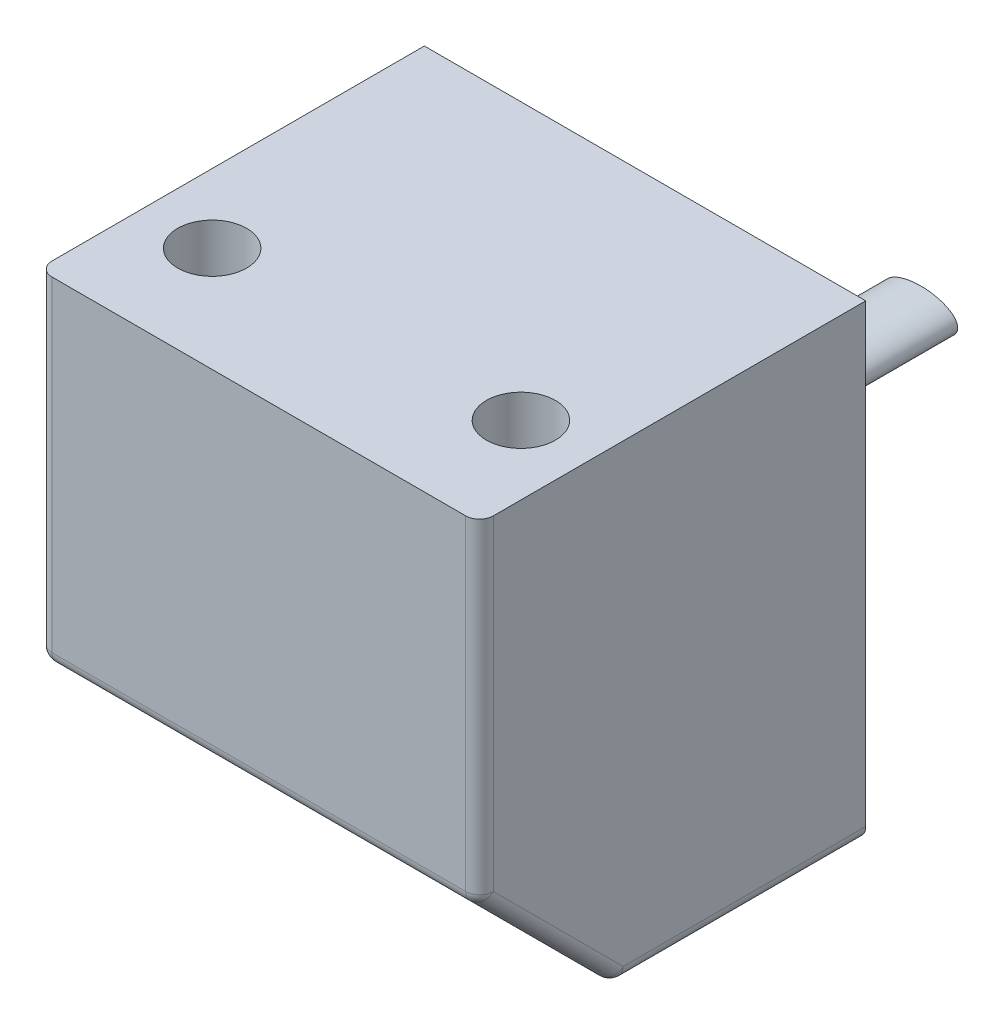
from build123d import *

# Parameters (mm, degrees)
ESQUISSE1_W               = 16
ESQUISSE1_H               = 17
EXTRUSION1_DEPTH          = 14
TROU_TARAUD_M3X0_51_D     = 2.5
TROU_TARAUD_M3X0_51_DEPTH = 5.5
TROU_TARAUD_M3X0_51_TIP   = 0.751075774
CHANFREIN1_SIZE           = 5
CONG_1_R                  = 0.5
ESQUISSE4_RX              = 1.335200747
ESQUISSE4_RY              = 0.650482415
EXTRUSION4_DEPTH          = 10


with BuildPart() as part:
    # Esquisse1 → Extrusion1 (new body)
    with BuildSketch(Plane.XY):
        with Locations((8, 8.5)):
            Rectangle(ESQUISSE1_W, ESQUISSE1_H)
    extrude(amount=EXTRUSION1_DEPTH)

    # Trou taraud_ M3x0.51
    with Locations(Plane(origin=(13.5, 17, 10), x_dir=(0, 0, 1), z_dir=(0, 1, 0))):
        with Locations((0, 0), (0.193934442, -10.998290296)):
            Hole(TROU_TARAUD_M3X0_51_D / 2, depth=TROU_TARAUD_M3X0_51_DEPTH)
            with Locations((0, 0, -(TROU_TARAUD_M3X0_51_DEPTH + TROU_TARAUD_M3X0_51_TIP / 2))):  # 118° drill point
                Cone(0, TROU_TARAUD_M3X0_51_D / 2, TROU_TARAUD_M3X0_51_TIP, mode=Mode.SUBTRACT)

    # Chanfrein1
    chanfrein1_edges = [part.edges().sort_by_distance(p)[0] for p in [
        (8, 0, 14),
    ]]
    chamfer(chanfrein1_edges, length=CHANFREIN1_SIZE)

    # Cong_1
    cong_1_edges = [part.edges().sort_by_distance(p)[0] for p in [
        (0, 0, 4.5),
        (8, 0, 9),
        (16, 0, 4.5),
        (0, 2.5, 11.5),
        (0, 11, 14),
        (8, 5, 14),
        (16, 2.5, 11.5),
        (16, 11, 14),
    ]]
    fillet(cong_1_edges, radius=CONG_1_R)

    # Esquisse4 → Extrusion4 (add)
    with BuildSketch(Plane(origin=(0, 0, 0), x_dir=(-1, 0, 0), z_dir=(0, 0, -1))):
        with Locations((-8, 7.815281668)):
            Ellipse(ESQUISSE4_RX, ESQUISSE4_RY)
    extrude(amount=EXTRUSION4_DEPTH)


solid = part.part
